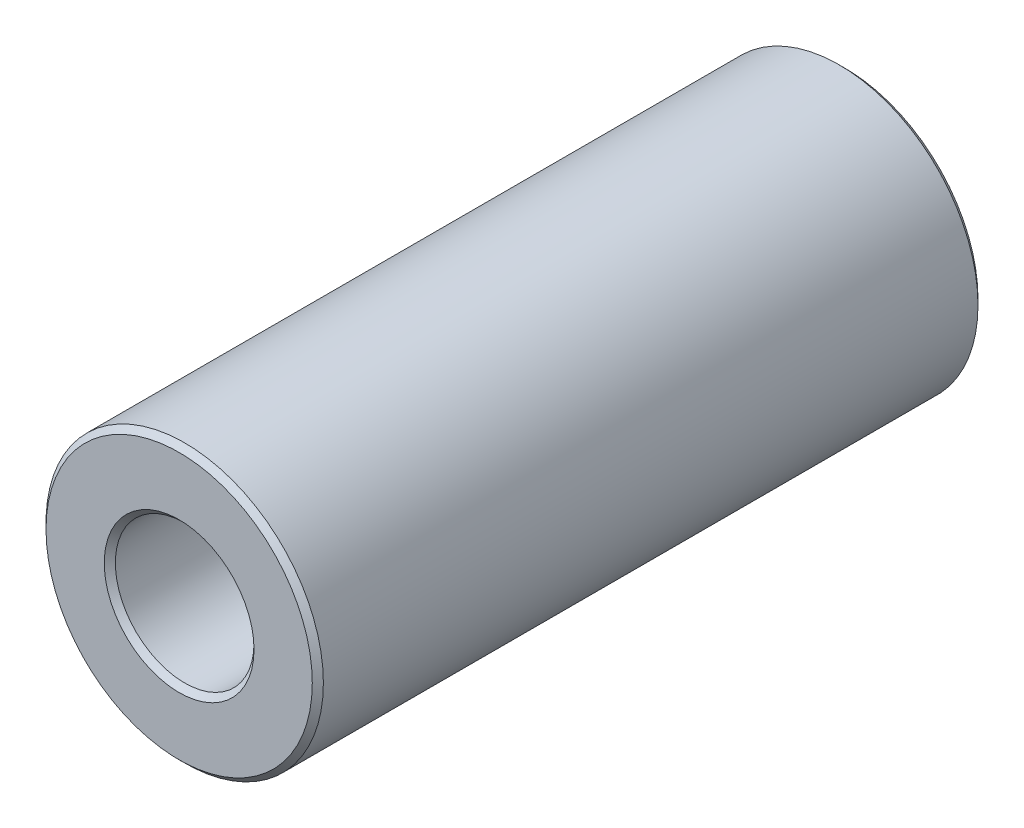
ISO-10303-21;
HEADER;
FILE_DESCRIPTION(('STEP AP214'),'2;1');
FILE_NAME('part.step','',(''),(''),'','','');
FILE_SCHEMA(('AUTOMOTIVE_DESIGN { 1 0 10303 214 1 1 1 1 }'));
ENDSEC;
DATA;
#1=APPLICATION_CONTEXT('core data for automotive mechanical design processes');
#2=APPLICATION_PROTOCOL_DEFINITION('international standard','automotive_design',2000,#1);
#3=PRODUCT_CONTEXT('',#1,'mechanical');
#4=PRODUCT('Part','Part','',(#3));
#5=PRODUCT_RELATED_PRODUCT_CATEGORY('part','',(#4));
#6=PRODUCT_DEFINITION_FORMATION('','',#4);
#7=PRODUCT_DEFINITION_CONTEXT('part definition',#1,'design');
#8=PRODUCT_DEFINITION('design','',#6,#7);
#9=PRODUCT_DEFINITION_SHAPE('','',#8);
#10=(LENGTH_UNIT() NAMED_UNIT(*) SI_UNIT(.MILLI.,.METRE.));
#11=(NAMED_UNIT(*) PLANE_ANGLE_UNIT() SI_UNIT($,.RADIAN.));
#12=(NAMED_UNIT(*) SI_UNIT($,.STERADIAN.) SOLID_ANGLE_UNIT());
#13=UNCERTAINTY_MEASURE_WITH_UNIT(LENGTH_MEASURE(1.E-05),#10,'distance_accuracy_value','');
#14=(GEOMETRIC_REPRESENTATION_CONTEXT(3) GLOBAL_UNCERTAINTY_ASSIGNED_CONTEXT((#13)) GLOBAL_UNIT_ASSIGNED_CONTEXT((#10,
#11,#12)) REPRESENTATION_CONTEXT('',''));
#15=CARTESIAN_POINT('',(0.,0.,0.));
#16=DIRECTION('',(0.,0.,1.));
#17=DIRECTION('',(1.,0.,0.));
#18=AXIS2_PLACEMENT_3D('',#15,#16,#17);
#19=CARTESIAN_POINT('',(0.,0.,6.));
#20=DIRECTION('',(0.,0.,1.));
#21=DIRECTION('',(1.,0.,0.));
#22=AXIS2_PLACEMENT_3D('',#19,#20,#21);
#23=PLANE('',#22);
#24=CARTESIAN_POINT('',(0.,0.,6.));
#25=DIRECTION('',(0.,0.,1.));
#26=DIRECTION('',(1.,0.,0.));
#27=AXIS2_PLACEMENT_3D('',#24,#25,#26);
#28=CIRCLE('',#27,1.35);
#29=CARTESIAN_POINT('',(1.35,0.,6.));
#30=VERTEX_POINT('',#29);
#31=EDGE_CURVE('E10',#30,#30,#28,.F.);
#32=ORIENTED_EDGE('',*,*,#31,.T.);
#33=EDGE_LOOP('',(#32));
#34=FACE_BOUND('',#33,.T.);
#35=CARTESIAN_POINT('',(0.,0.,6.));
#36=DIRECTION('',(0.,0.,1.));
#37=DIRECTION('',(1.,0.,0.));
#38=AXIS2_PLACEMENT_3D('',#35,#36,#37);
#39=CIRCLE('',#38,2.4);
#40=CARTESIAN_POINT('',(2.4,0.,6.));
#41=VERTEX_POINT('',#40);
#42=EDGE_CURVE('E45',#41,#41,#39,.T.);
#43=ORIENTED_EDGE('',*,*,#42,.T.);
#44=EDGE_LOOP('',(#43));
#45=FACE_BOUND('',#44,.T.);
#46=ADVANCED_FACE('F37',(#34,#45),#23,.T.);
#47=CARTESIAN_POINT('',(0.,0.,-6.));
#48=DIRECTION('',(0.,0.,1.));
#49=DIRECTION('',(1.,0.,0.));
#50=AXIS2_PLACEMENT_3D('',#47,#48,#49);
#51=PLANE('',#50);
#52=CARTESIAN_POINT('',(0.,0.,-6.));
#53=DIRECTION('',(0.,0.,1.));
#54=DIRECTION('',(1.,0.,0.));
#55=AXIS2_PLACEMENT_3D('',#52,#53,#54);
#56=CIRCLE('',#55,2.4);
#57=CARTESIAN_POINT('',(2.4,0.,-6.));
#58=VERTEX_POINT('',#57);
#59=EDGE_CURVE('E62',#58,#58,#56,.F.);
#60=ORIENTED_EDGE('',*,*,#59,.T.);
#61=EDGE_LOOP('',(#60));
#62=FACE_BOUND('',#61,.T.);
#63=CARTESIAN_POINT('',(0.,0.,-6.));
#64=DIRECTION('',(0.,0.,1.));
#65=DIRECTION('',(1.,0.,0.));
#66=AXIS2_PLACEMENT_3D('',#63,#64,#65);
#67=CIRCLE('',#66,1.35);
#68=CARTESIAN_POINT('',(1.35,0.,-6.));
#69=VERTEX_POINT('',#68);
#70=EDGE_CURVE('E66',#69,#69,#67,.T.);
#71=ORIENTED_EDGE('',*,*,#70,.T.);
#72=EDGE_LOOP('',(#71));
#73=FACE_BOUND('',#72,.T.);
#74=ADVANCED_FACE('F89',(#62,#73),#51,.F.);
#75=CARTESIAN_POINT('',(0.,0.,6.));
#76=DIRECTION('',(0.,0.,-1.));
#77=DIRECTION('',(-1.,0.,0.));
#78=AXIS2_PLACEMENT_3D('',#75,#76,#77);
#79=CYLINDRICAL_SURFACE('',#78,2.5);
#80=CARTESIAN_POINT('',(0.,0.,-5.9));
#81=DIRECTION('',(0.,0.,1.));
#82=DIRECTION('',(1.,0.,0.));
#83=AXIS2_PLACEMENT_3D('',#80,#81,#82);
#84=CIRCLE('',#83,2.5);
#85=CARTESIAN_POINT('',(2.5,0.,-5.9));
#86=VERTEX_POINT('',#85);
#87=EDGE_CURVE('E70',#86,#86,#84,.T.);
#88=ORIENTED_EDGE('',*,*,#87,.T.);
#89=EDGE_LOOP('',(#88));
#90=FACE_BOUND('',#89,.T.);
#91=CARTESIAN_POINT('',(0.,0.,5.9));
#92=DIRECTION('',(0.,0.,1.));
#93=DIRECTION('',(1.,0.,0.));
#94=AXIS2_PLACEMENT_3D('',#91,#92,#93);
#95=CIRCLE('',#94,2.5);
#96=CARTESIAN_POINT('',(2.5,0.,5.9));
#97=VERTEX_POINT('',#96);
#98=EDGE_CURVE('E74',#97,#97,#95,.F.);
#99=ORIENTED_EDGE('',*,*,#98,.T.);
#100=EDGE_LOOP('',(#99));
#101=FACE_BOUND('',#100,.T.);
#102=ADVANCED_FACE('F78',(#90,#101),#79,.T.);
#103=CARTESIAN_POINT('',(0.,0.,6.));
#104=DIRECTION('',(0.,0.,-1.));
#105=DIRECTION('',(-1.,0.,0.));
#106=AXIS2_PLACEMENT_3D('',#103,#104,#105);
#107=CYLINDRICAL_SURFACE('',#106,1.25);
#108=CARTESIAN_POINT('',(0.,0.,-5.9));
#109=DIRECTION('',(0.,0.,1.));
#110=DIRECTION('',(1.,0.,0.));
#111=AXIS2_PLACEMENT_3D('',#108,#109,#110);
#112=CIRCLE('',#111,1.25);
#113=CARTESIAN_POINT('',(1.25,0.,-5.9));
#114=VERTEX_POINT('',#113);
#115=EDGE_CURVE('E52',#114,#114,#112,.F.);
#116=ORIENTED_EDGE('',*,*,#115,.T.);
#117=EDGE_LOOP('',(#116));
#118=FACE_BOUND('',#117,.T.);
#119=CARTESIAN_POINT('',(0.,0.,5.9));
#120=DIRECTION('',(0.,0.,1.));
#121=DIRECTION('',(1.,0.,0.));
#122=AXIS2_PLACEMENT_3D('',#119,#120,#121);
#123=CIRCLE('',#122,1.25);
#124=CARTESIAN_POINT('',(1.25,0.,5.9));
#125=VERTEX_POINT('',#124);
#126=EDGE_CURVE('E57',#125,#125,#123,.T.);
#127=ORIENTED_EDGE('',*,*,#126,.T.);
#128=EDGE_LOOP('',(#127));
#129=FACE_BOUND('',#128,.T.);
#130=ADVANCED_FACE('F97',(#118,#129),#107,.F.);
#131=CARTESIAN_POINT('',(0.,0.,-5.9));
#132=DIRECTION('',(0.,0.,1.));
#133=DIRECTION('',(1.,0.,0.));
#134=AXIS2_PLACEMENT_3D('',#131,#132,#133);
#135=CONICAL_SURFACE('',#134,2.5,0.785398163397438);
#136=ORIENTED_EDGE('',*,*,#59,.F.);
#137=EDGE_LOOP('',(#136));
#138=FACE_BOUND('',#137,.T.);
#139=ORIENTED_EDGE('',*,*,#87,.F.);
#140=EDGE_LOOP('',(#139));
#141=FACE_BOUND('',#140,.T.);
#142=ADVANCED_FACE('F102',(#138,#141),#135,.T.);
#143=CARTESIAN_POINT('',(0.,0.,-6.));
#144=DIRECTION('',(0.,0.,-1.));
#145=DIRECTION('',(-1.,0.,0.));
#146=AXIS2_PLACEMENT_3D('',#143,#144,#145);
#147=CONICAL_SURFACE('',#146,1.35,0.785398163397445);
#148=ORIENTED_EDGE('',*,*,#115,.F.);
#149=EDGE_LOOP('',(#148));
#150=FACE_BOUND('',#149,.T.);
#151=ORIENTED_EDGE('',*,*,#70,.F.);
#152=EDGE_LOOP('',(#151));
#153=FACE_BOUND('',#152,.T.);
#154=ADVANCED_FACE('F86',(#150,#153),#147,.F.);
#155=CARTESIAN_POINT('',(0.,0.,5.9));
#156=DIRECTION('',(0.,0.,1.));
#157=DIRECTION('',(1.,0.,0.));
#158=AXIS2_PLACEMENT_3D('',#155,#156,#157);
#159=CONICAL_SURFACE('',#158,1.25,0.785398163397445);
#160=ORIENTED_EDGE('',*,*,#31,.F.);
#161=EDGE_LOOP('',(#160));
#162=FACE_BOUND('',#161,.T.);
#163=ORIENTED_EDGE('',*,*,#126,.F.);
#164=EDGE_LOOP('',(#163));
#165=FACE_BOUND('',#164,.T.);
#166=ADVANCED_FACE('F82',(#162,#165),#159,.F.);
#167=CARTESIAN_POINT('',(0.,0.,6.));
#168=DIRECTION('',(0.,0.,-1.));
#169=DIRECTION('',(-1.,0.,0.));
#170=AXIS2_PLACEMENT_3D('',#167,#168,#169);
#171=CONICAL_SURFACE('',#170,2.4,0.785398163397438);
#172=ORIENTED_EDGE('',*,*,#98,.F.);
#173=EDGE_LOOP('',(#172));
#174=FACE_BOUND('',#173,.T.);
#175=ORIENTED_EDGE('',*,*,#42,.F.);
#176=EDGE_LOOP('',(#175));
#177=FACE_BOUND('',#176,.T.);
#178=ADVANCED_FACE('F39',(#174,#177),#171,.T.);
#179=CLOSED_SHELL('',(#46,#74,#102,#130,#142,#154,#166,#178));
#180=MANIFOLD_SOLID_BREP('B2',#179);
#181=ADVANCED_BREP_SHAPE_REPRESENTATION('',(#18,#180),#14);
#182=SHAPE_DEFINITION_REPRESENTATION(#9,#181);
ENDSEC;
END-ISO-10303-21;
